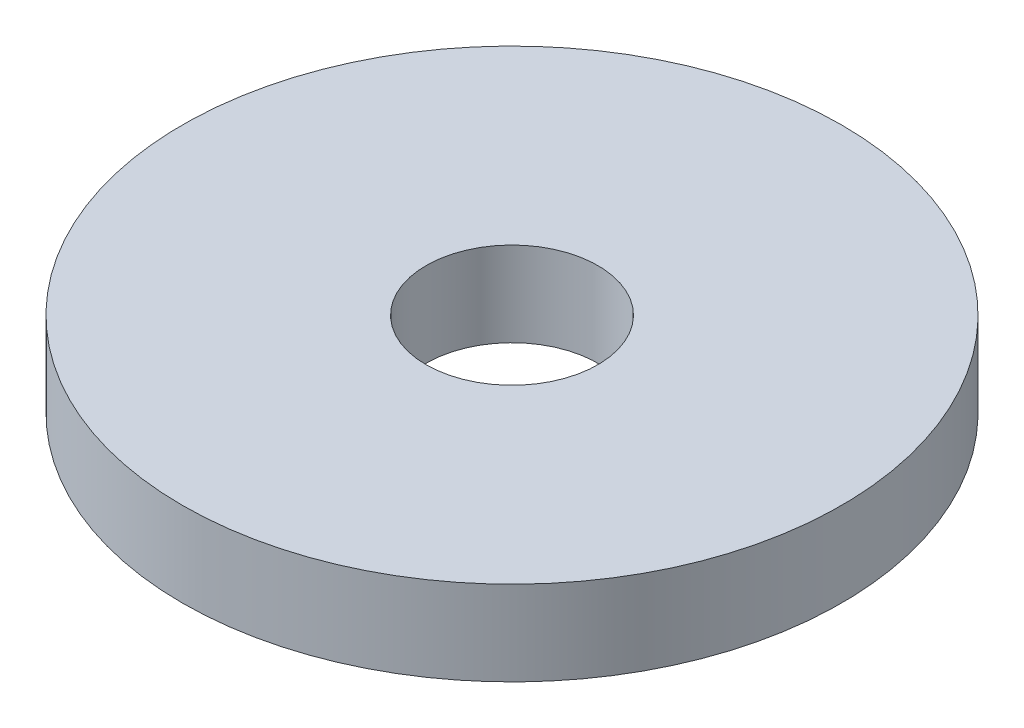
ISO-10303-21;
HEADER;
FILE_DESCRIPTION(('STEP AP214'),'2;1');
FILE_NAME('part.step','',(''),(''),'','','');
FILE_SCHEMA(('AUTOMOTIVE_DESIGN { 1 0 10303 214 1 1 1 1 }'));
ENDSEC;
DATA;
#1=APPLICATION_CONTEXT('core data for automotive mechanical design processes');
#2=APPLICATION_PROTOCOL_DEFINITION('international standard','automotive_design',2000,#1);
#3=PRODUCT_CONTEXT('',#1,'mechanical');
#4=PRODUCT('Part','Part','',(#3));
#5=PRODUCT_RELATED_PRODUCT_CATEGORY('part','',(#4));
#6=PRODUCT_DEFINITION_FORMATION('','',#4);
#7=PRODUCT_DEFINITION_CONTEXT('part definition',#1,'design');
#8=PRODUCT_DEFINITION('design','',#6,#7);
#9=PRODUCT_DEFINITION_SHAPE('','',#8);
#10=(LENGTH_UNIT() NAMED_UNIT(*) SI_UNIT(.MILLI.,.METRE.));
#11=(NAMED_UNIT(*) PLANE_ANGLE_UNIT() SI_UNIT($,.RADIAN.));
#12=(NAMED_UNIT(*) SI_UNIT($,.STERADIAN.) SOLID_ANGLE_UNIT());
#13=UNCERTAINTY_MEASURE_WITH_UNIT(LENGTH_MEASURE(1.E-05),#10,'distance_accuracy_value','');
#14=(GEOMETRIC_REPRESENTATION_CONTEXT(3) GLOBAL_UNCERTAINTY_ASSIGNED_CONTEXT((#13)) GLOBAL_UNIT_ASSIGNED_CONTEXT((#10,
#11,#12)) REPRESENTATION_CONTEXT('',''));
#15=CARTESIAN_POINT('',(0.,0.,0.));
#16=DIRECTION('',(0.,0.,1.));
#17=DIRECTION('',(1.,0.,0.));
#18=AXIS2_PLACEMENT_3D('',#15,#16,#17);
#19=CARTESIAN_POINT('',(0.,3.3,0.));
#20=DIRECTION('',(0.,1.,0.));
#21=DIRECTION('',(0.,0.,1.));
#22=AXIS2_PLACEMENT_3D('',#19,#20,#21);
#23=PLANE('',#22);
#24=CARTESIAN_POINT('',(0.,3.3,0.));
#25=DIRECTION('',(0.,1.,0.));
#26=DIRECTION('',(0.,0.,1.));
#27=AXIS2_PLACEMENT_3D('',#24,#25,#26);
#28=CIRCLE('',#27,12.85);
#29=CARTESIAN_POINT('',(0.,3.3,12.85));
#30=VERTEX_POINT('',#29);
#31=EDGE_CURVE('E10',#30,#30,#28,.T.);
#32=ORIENTED_EDGE('',*,*,#31,.T.);
#33=EDGE_LOOP('',(#32));
#34=FACE_BOUND('',#33,.T.);
#35=CARTESIAN_POINT('',(0.,3.3,0.));
#36=DIRECTION('',(0.,1.,0.));
#37=DIRECTION('',(0.,0.,1.));
#38=AXIS2_PLACEMENT_3D('',#35,#36,#37);
#39=CIRCLE('',#38,3.35);
#40=CARTESIAN_POINT('',(0.,3.3,3.35));
#41=VERTEX_POINT('',#40);
#42=EDGE_CURVE('E50',#41,#41,#39,.T.);
#43=ORIENTED_EDGE('',*,*,#42,.F.);
#44=EDGE_LOOP('',(#43));
#45=FACE_BOUND('',#44,.T.);
#46=ADVANCED_FACE('F37',(#34,#45),#23,.T.);
#47=CARTESIAN_POINT('',(0.,0.,0.));
#48=DIRECTION('',(0.,1.,0.));
#49=DIRECTION('',(0.,0.,1.));
#50=AXIS2_PLACEMENT_3D('',#47,#48,#49);
#51=PLANE('',#50);
#52=CARTESIAN_POINT('',(0.,0.,0.));
#53=DIRECTION('',(0.,1.,0.));
#54=DIRECTION('',(0.,0.,1.));
#55=AXIS2_PLACEMENT_3D('',#52,#53,#54);
#56=CIRCLE('',#55,12.85);
#57=CARTESIAN_POINT('',(0.,0.,12.85));
#58=VERTEX_POINT('',#57);
#59=EDGE_CURVE('E41',#58,#58,#56,.T.);
#60=ORIENTED_EDGE('',*,*,#59,.F.);
#61=EDGE_LOOP('',(#60));
#62=FACE_BOUND('',#61,.T.);
#63=CARTESIAN_POINT('',(0.,0.,0.));
#64=DIRECTION('',(0.,1.,0.));
#65=DIRECTION('',(0.,0.,1.));
#66=AXIS2_PLACEMENT_3D('',#63,#64,#65);
#67=CIRCLE('',#66,3.35);
#68=CARTESIAN_POINT('',(0.,0.,3.35));
#69=VERTEX_POINT('',#68);
#70=EDGE_CURVE('E52',#69,#69,#67,.T.);
#71=ORIENTED_EDGE('',*,*,#70,.T.);
#72=EDGE_LOOP('',(#71));
#73=FACE_BOUND('',#72,.T.);
#74=ADVANCED_FACE('F64',(#62,#73),#51,.F.);
#75=CARTESIAN_POINT('',(0.,3.3,0.));
#76=DIRECTION('',(0.,-1.,0.));
#77=DIRECTION('',(0.,0.,-1.));
#78=AXIS2_PLACEMENT_3D('',#75,#76,#77);
#79=CYLINDRICAL_SURFACE('',#78,12.85);
#80=ORIENTED_EDGE('',*,*,#31,.F.);
#81=EDGE_LOOP('',(#80));
#82=FACE_BOUND('',#81,.T.);
#83=ORIENTED_EDGE('',*,*,#59,.T.);
#84=EDGE_LOOP('',(#83));
#85=FACE_BOUND('',#84,.T.);
#86=ADVANCED_FACE('F39',(#82,#85),#79,.T.);
#87=CARTESIAN_POINT('',(0.,3.3,0.));
#88=DIRECTION('',(0.,-1.,0.));
#89=DIRECTION('',(0.,0.,-1.));
#90=AXIS2_PLACEMENT_3D('',#87,#88,#89);
#91=CYLINDRICAL_SURFACE('',#90,3.35);
#92=ORIENTED_EDGE('',*,*,#42,.T.);
#93=EDGE_LOOP('',(#92));
#94=FACE_BOUND('',#93,.T.);
#95=ORIENTED_EDGE('',*,*,#70,.F.);
#96=EDGE_LOOP('',(#95));
#97=FACE_BOUND('',#96,.T.);
#98=ADVANCED_FACE('F60',(#94,#97),#91,.F.);
#99=CLOSED_SHELL('',(#46,#74,#86,#98));
#100=MANIFOLD_SOLID_BREP('B2',#99);
#101=ADVANCED_BREP_SHAPE_REPRESENTATION('',(#18,#100),#14);
#102=SHAPE_DEFINITION_REPRESENTATION(#9,#101);
ENDSEC;
END-ISO-10303-21;
